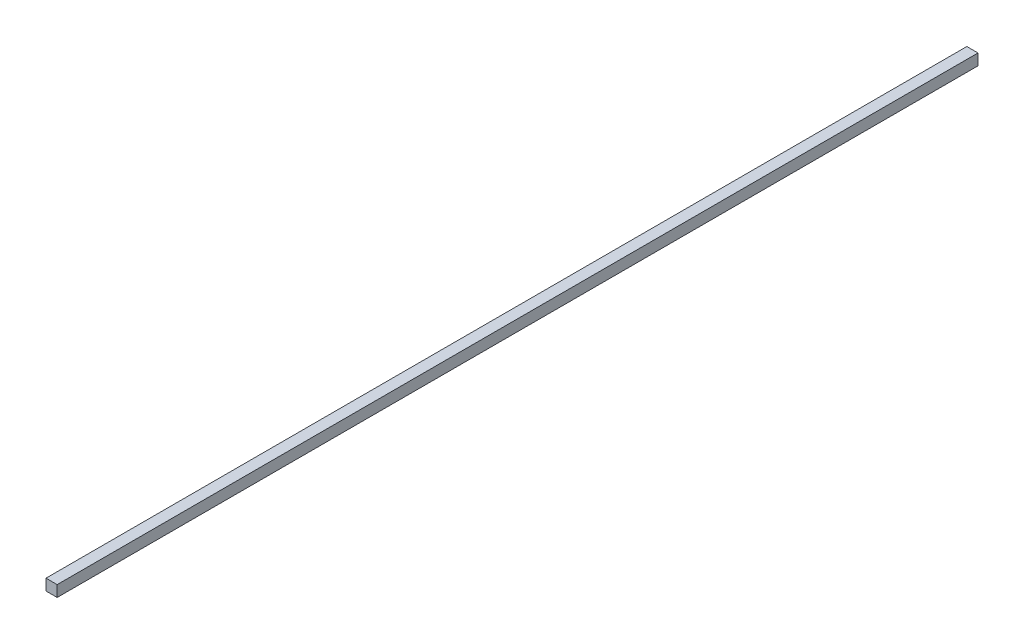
ISO-10303-21;
HEADER;
FILE_DESCRIPTION(('STEP AP214'),'2;1');
FILE_NAME('part.step','',(''),(''),'','','');
FILE_SCHEMA(('AUTOMOTIVE_DESIGN { 1 0 10303 214 1 1 1 1 }'));
ENDSEC;
DATA;
#1=APPLICATION_CONTEXT('core data for automotive mechanical design processes');
#2=APPLICATION_PROTOCOL_DEFINITION('international standard','automotive_design',2000,#1);
#3=PRODUCT_CONTEXT('',#1,'mechanical');
#4=PRODUCT('Part','Part','',(#3));
#5=PRODUCT_RELATED_PRODUCT_CATEGORY('part','',(#4));
#6=PRODUCT_DEFINITION_FORMATION('','',#4);
#7=PRODUCT_DEFINITION_CONTEXT('part definition',#1,'design');
#8=PRODUCT_DEFINITION('design','',#6,#7);
#9=PRODUCT_DEFINITION_SHAPE('','',#8);
#10=(LENGTH_UNIT() NAMED_UNIT(*) SI_UNIT(.MILLI.,.METRE.));
#11=(NAMED_UNIT(*) PLANE_ANGLE_UNIT() SI_UNIT($,.RADIAN.));
#12=(NAMED_UNIT(*) SI_UNIT($,.STERADIAN.) SOLID_ANGLE_UNIT());
#13=UNCERTAINTY_MEASURE_WITH_UNIT(LENGTH_MEASURE(1.E-05),#10,'distance_accuracy_value','');
#14=(GEOMETRIC_REPRESENTATION_CONTEXT(3) GLOBAL_UNCERTAINTY_ASSIGNED_CONTEXT((#13)) GLOBAL_UNIT_ASSIGNED_CONTEXT((#10,
#11,#12)) REPRESENTATION_CONTEXT('',''));
#15=CARTESIAN_POINT('',(0.,0.,0.));
#16=DIRECTION('',(0.,0.,1.));
#17=DIRECTION('',(1.,0.,0.));
#18=AXIS2_PLACEMENT_3D('',#15,#16,#17);
#19=CARTESIAN_POINT('',(-1.,1.,82.5));
#20=DIRECTION('',(1.,0.,0.));
#21=DIRECTION('',(0.,0.,-1.));
#22=AXIS2_PLACEMENT_3D('',#19,#20,#21);
#23=PLANE('',#22);
#24=DIRECTION('',(0.,-1.,0.));
#25=VECTOR('',#24,1.);
#26=CARTESIAN_POINT('',(-1.,1.,-82.5));
#27=LINE('',#26,#25);
#28=CARTESIAN_POINT('',(-1.,1.,-82.5));
#29=VERTEX_POINT('',#28);
#30=CARTESIAN_POINT('',(-1.,-1.,-82.5));
#31=VERTEX_POINT('',#30);
#32=EDGE_CURVE('E70',#29,#31,#27,.T.);
#33=ORIENTED_EDGE('',*,*,#32,.T.);
#34=DIRECTION('',(0.,0.,-1.));
#35=VECTOR('',#34,1.);
#36=CARTESIAN_POINT('',(-1.,-1.,82.5));
#37=LINE('',#36,#35);
#38=CARTESIAN_POINT('',(-1.,-1.,82.5));
#39=VERTEX_POINT('',#38);
#40=EDGE_CURVE('E11',#39,#31,#37,.T.);
#41=ORIENTED_EDGE('',*,*,#40,.F.);
#42=DIRECTION('',(0.,-1.,0.));
#43=VECTOR('',#42,1.);
#44=CARTESIAN_POINT('',(-1.,1.,82.5));
#45=LINE('',#44,#43);
#46=CARTESIAN_POINT('',(-1.,1.,82.5));
#47=VERTEX_POINT('',#46);
#48=EDGE_CURVE('E88',#47,#39,#45,.T.);
#49=ORIENTED_EDGE('',*,*,#48,.F.);
#50=DIRECTION('',(0.,0.,-1.));
#51=VECTOR('',#50,1.);
#52=CARTESIAN_POINT('',(-1.,1.,82.5));
#53=LINE('',#52,#51);
#54=EDGE_CURVE('E82',#47,#29,#53,.T.);
#55=ORIENTED_EDGE('',*,*,#54,.T.);
#56=EDGE_LOOP('',(#33,#41,#49,#55));
#57=FACE_BOUND('',#56,.T.);
#58=ADVANCED_FACE('F26',(#57),#23,.F.);
#59=CARTESIAN_POINT('',(-1.,-1.,82.5));
#60=DIRECTION('',(0.,1.,0.));
#61=DIRECTION('',(0.,0.,1.));
#62=AXIS2_PLACEMENT_3D('',#59,#60,#61);
#63=PLANE('',#62);
#64=DIRECTION('',(1.,0.,0.));
#65=VECTOR('',#64,1.);
#66=CARTESIAN_POINT('',(-1.,-1.,-82.5));
#67=LINE('',#66,#65);
#68=CARTESIAN_POINT('',(1.,-1.,-82.5));
#69=VERTEX_POINT('',#68);
#70=EDGE_CURVE('E66',#31,#69,#67,.T.);
#71=ORIENTED_EDGE('',*,*,#70,.T.);
#72=DIRECTION('',(0.,0.,-1.));
#73=VECTOR('',#72,1.);
#74=CARTESIAN_POINT('',(1.,-1.,82.5));
#75=LINE('',#74,#73);
#76=CARTESIAN_POINT('',(1.,-1.,82.5));
#77=VERTEX_POINT('',#76);
#78=EDGE_CURVE('E33',#77,#69,#75,.T.);
#79=ORIENTED_EDGE('',*,*,#78,.F.);
#80=DIRECTION('',(1.,0.,0.));
#81=VECTOR('',#80,1.);
#82=CARTESIAN_POINT('',(-1.,-1.,82.5));
#83=LINE('',#82,#81);
#84=EDGE_CURVE('E78',#39,#77,#83,.T.);
#85=ORIENTED_EDGE('',*,*,#84,.F.);
#86=ORIENTED_EDGE('',*,*,#40,.T.);
#87=EDGE_LOOP('',(#71,#79,#85,#86));
#88=FACE_BOUND('',#87,.T.);
#89=ADVANCED_FACE('F77',(#88),#63,.F.);
#90=CARTESIAN_POINT('',(1.,1.,82.5));
#91=DIRECTION('',(-1.,0.,0.));
#92=DIRECTION('',(0.,-1.,0.));
#93=AXIS2_PLACEMENT_3D('',#90,#91,#92);
#94=PLANE('',#93);
#95=DIRECTION('',(0.,1.,0.));
#96=VECTOR('',#95,1.);
#97=CARTESIAN_POINT('',(1.,1.,-82.5));
#98=LINE('',#97,#96);
#99=CARTESIAN_POINT('',(1.,1.,-82.5));
#100=VERTEX_POINT('',#99);
#101=EDGE_CURVE('E71',#69,#100,#98,.T.);
#102=ORIENTED_EDGE('',*,*,#101,.T.);
#103=DIRECTION('',(0.,0.,-1.));
#104=VECTOR('',#103,1.);
#105=CARTESIAN_POINT('',(1.,1.,82.5));
#106=LINE('',#105,#104);
#107=CARTESIAN_POINT('',(1.,1.,82.5));
#108=VERTEX_POINT('',#107);
#109=EDGE_CURVE('E94',#108,#100,#106,.T.);
#110=ORIENTED_EDGE('',*,*,#109,.F.);
#111=DIRECTION('',(0.,1.,0.));
#112=VECTOR('',#111,1.);
#113=CARTESIAN_POINT('',(1.,1.,82.5));
#114=LINE('',#113,#112);
#115=EDGE_CURVE('E45',#77,#108,#114,.T.);
#116=ORIENTED_EDGE('',*,*,#115,.F.);
#117=ORIENTED_EDGE('',*,*,#78,.T.);
#118=EDGE_LOOP('',(#102,#110,#116,#117));
#119=FACE_BOUND('',#118,.T.);
#120=ADVANCED_FACE('F97',(#119),#94,.F.);
#121=CARTESIAN_POINT('',(-1.,1.,82.5));
#122=DIRECTION('',(0.,-1.,0.));
#123=DIRECTION('',(1.,0.,0.));
#124=AXIS2_PLACEMENT_3D('',#121,#122,#123);
#125=PLANE('',#124);
#126=DIRECTION('',(-1.,0.,0.));
#127=VECTOR('',#126,1.);
#128=CARTESIAN_POINT('',(-1.,1.,-82.5));
#129=LINE('',#128,#127);
#130=EDGE_CURVE('E86',#100,#29,#129,.T.);
#131=ORIENTED_EDGE('',*,*,#130,.T.);
#132=ORIENTED_EDGE('',*,*,#54,.F.);
#133=DIRECTION('',(-1.,0.,0.));
#134=VECTOR('',#133,1.);
#135=CARTESIAN_POINT('',(-1.,1.,82.5));
#136=LINE('',#135,#134);
#137=EDGE_CURVE('E40',#108,#47,#136,.T.);
#138=ORIENTED_EDGE('',*,*,#137,.F.);
#139=ORIENTED_EDGE('',*,*,#109,.T.);
#140=EDGE_LOOP('',(#131,#132,#138,#139));
#141=FACE_BOUND('',#140,.T.);
#142=ADVANCED_FACE('F99',(#141),#125,.F.);
#143=CARTESIAN_POINT('',(-1.,-1.,82.5));
#144=DIRECTION('',(0.,0.,1.));
#145=DIRECTION('',(1.,0.,0.));
#146=AXIS2_PLACEMENT_3D('',#143,#144,#145);
#147=PLANE('',#146);
#148=ORIENTED_EDGE('',*,*,#48,.T.);
#149=ORIENTED_EDGE('',*,*,#84,.T.);
#150=ORIENTED_EDGE('',*,*,#115,.T.);
#151=ORIENTED_EDGE('',*,*,#137,.T.);
#152=EDGE_LOOP('',(#148,#149,#150,#151));
#153=FACE_BOUND('',#152,.T.);
#154=ADVANCED_FACE('F100',(#153),#147,.T.);
#155=CARTESIAN_POINT('',(-1.,-1.,-82.5));
#156=DIRECTION('',(0.,0.,1.));
#157=DIRECTION('',(1.,0.,0.));
#158=AXIS2_PLACEMENT_3D('',#155,#156,#157);
#159=PLANE('',#158);
#160=ORIENTED_EDGE('',*,*,#32,.F.);
#161=ORIENTED_EDGE('',*,*,#130,.F.);
#162=ORIENTED_EDGE('',*,*,#101,.F.);
#163=ORIENTED_EDGE('',*,*,#70,.F.);
#164=EDGE_LOOP('',(#160,#161,#162,#163));
#165=FACE_BOUND('',#164,.T.);
#166=ADVANCED_FACE('F67',(#165),#159,.F.);
#167=CLOSED_SHELL('',(#58,#89,#120,#142,#154,#166));
#168=MANIFOLD_SOLID_BREP('B2',#167);
#169=ADVANCED_BREP_SHAPE_REPRESENTATION('',(#18,#168),#14);
#170=SHAPE_DEFINITION_REPRESENTATION(#9,#169);
ENDSEC;
END-ISO-10303-21;
